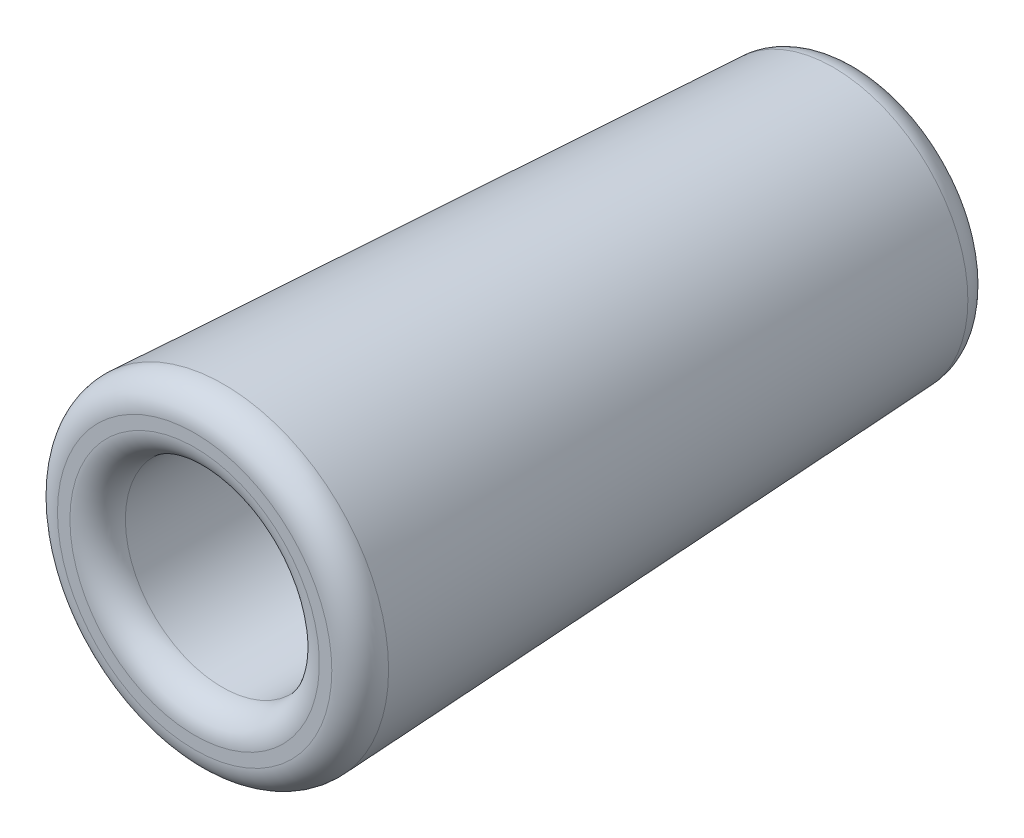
ISO-10303-21;
HEADER;
FILE_DESCRIPTION(('STEP AP214'),'2;1');
FILE_NAME('part.step','',(''),(''),'','','');
FILE_SCHEMA(('AUTOMOTIVE_DESIGN { 1 0 10303 214 1 1 1 1 }'));
ENDSEC;
DATA;
#1=APPLICATION_CONTEXT('core data for automotive mechanical design processes');
#2=APPLICATION_PROTOCOL_DEFINITION('international standard','automotive_design',2000,#1);
#3=PRODUCT_CONTEXT('',#1,'mechanical');
#4=PRODUCT('Part','Part','',(#3));
#5=PRODUCT_RELATED_PRODUCT_CATEGORY('part','',(#4));
#6=PRODUCT_DEFINITION_FORMATION('','',#4);
#7=PRODUCT_DEFINITION_CONTEXT('part definition',#1,'design');
#8=PRODUCT_DEFINITION('design','',#6,#7);
#9=PRODUCT_DEFINITION_SHAPE('','',#8);
#10=(LENGTH_UNIT() NAMED_UNIT(*) SI_UNIT(.MILLI.,.METRE.));
#11=(NAMED_UNIT(*) PLANE_ANGLE_UNIT() SI_UNIT($,.RADIAN.));
#12=(NAMED_UNIT(*) SI_UNIT($,.STERADIAN.) SOLID_ANGLE_UNIT());
#13=UNCERTAINTY_MEASURE_WITH_UNIT(LENGTH_MEASURE(1.E-05),#10,'distance_accuracy_value','');
#14=(GEOMETRIC_REPRESENTATION_CONTEXT(3) GLOBAL_UNCERTAINTY_ASSIGNED_CONTEXT((#13)) GLOBAL_UNIT_ASSIGNED_CONTEXT((#10,
#11,#12)) REPRESENTATION_CONTEXT('',''));
#15=CARTESIAN_POINT('',(0.,0.,0.));
#16=DIRECTION('',(0.,0.,1.));
#17=DIRECTION('',(1.,0.,0.));
#18=AXIS2_PLACEMENT_3D('',#15,#16,#17);
#19=CARTESIAN_POINT('',(0.,1.75,-6.));
#20=DIRECTION('',(0.,0.,-1.));
#21=DIRECTION('',(-1.,0.,0.));
#22=AXIS2_PLACEMENT_3D('',#19,#20,#21);
#23=PLANE('',#22);
#24=CARTESIAN_POINT('',(0.,0.,-6.));
#25=DIRECTION('',(0.,0.,-1.));
#26=DIRECTION('',(-1.,0.,0.));
#27=AXIS2_PLACEMENT_3D('',#24,#25,#26);
#28=CIRCLE('',#27,1.25);
#29=CARTESIAN_POINT('',(-1.25,0.,-6.));
#30=VERTEX_POINT('',#29);
#31=EDGE_CURVE('E44',#30,#30,#28,.F.);
#32=ORIENTED_EDGE('',*,*,#31,.T.);
#33=EDGE_LOOP('',(#32));
#34=FACE_BOUND('',#33,.T.);
#35=ADVANCED_FACE('F29',(#34),#23,.F.);
#36=CARTESIAN_POINT('',(0.,0.,-12.));
#37=DIRECTION('',(0.,0.,1.));
#38=DIRECTION('',(1.,0.,0.));
#39=AXIS2_PLACEMENT_3D('',#36,#37,#38);
#40=PLANE('',#39);
#41=CARTESIAN_POINT('',(0.,0.,-12.));
#42=DIRECTION('',(0.,0.,1.));
#43=DIRECTION('',(1.,0.,0.));
#44=AXIS2_PLACEMENT_3D('',#41,#42,#43);
#45=CIRCLE('',#44,1.92437539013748);
#46=CARTESIAN_POINT('',(1.92437539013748,0.,-12.));
#47=VERTEX_POINT('',#46);
#48=EDGE_CURVE('E10',#47,#47,#45,.F.);
#49=ORIENTED_EDGE('',*,*,#48,.T.);
#50=EDGE_LOOP('',(#49));
#51=FACE_BOUND('',#50,.T.);
#52=ADVANCED_FACE('F73',(#51),#40,.F.);
#53=CARTESIAN_POINT('',(0.,0.,-12.));
#54=DIRECTION('',(0.,0.,1.));
#55=DIRECTION('',(1.,0.,0.));
#56=AXIS2_PLACEMENT_3D('',#53,#54,#55);
#57=CONICAL_SURFACE('',#56,2.4,0.0499583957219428);
#58=CARTESIAN_POINT('',(0.,0.,-11.5249688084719));
#59=DIRECTION('',(0.,0.,-1.));
#60=DIRECTION('',(-1.,0.,0.));
#61=AXIS2_PLACEMENT_3D('',#58,#59,#60);
#62=CIRCLE('',#61,2.4237515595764);
#63=CARTESIAN_POINT('',(-2.4237515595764,0.,-11.5249688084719));
#64=VERTEX_POINT('',#63);
#65=EDGE_CURVE('E36',#64,#64,#62,.F.);
#66=ORIENTED_EDGE('',*,*,#65,.T.);
#67=EDGE_LOOP('',(#66));
#68=FACE_BOUND('',#67,.T.);
#69=CARTESIAN_POINT('',(0.,0.,-0.524968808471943));
#70=DIRECTION('',(0.,0.,-1.));
#71=DIRECTION('',(-1.,0.,0.));
#72=AXIS2_PLACEMENT_3D('',#69,#70,#71);
#73=CIRCLE('',#72,2.9737515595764);
#74=CARTESIAN_POINT('',(-2.9737515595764,0.,-0.524968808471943));
#75=VERTEX_POINT('',#74);
#76=EDGE_CURVE('E40',#75,#75,#73,.T.);
#77=ORIENTED_EDGE('',*,*,#76,.T.);
#78=EDGE_LOOP('',(#77));
#79=FACE_BOUND('',#78,.T.);
#80=ADVANCED_FACE('F78',(#68,#79),#57,.T.);
#81=CARTESIAN_POINT('',(0.,3.,0.));
#82=DIRECTION('',(0.,0.,-1.));
#83=DIRECTION('',(-1.,0.,0.));
#84=AXIS2_PLACEMENT_3D('',#81,#82,#83);
#85=PLANE('',#84);
#86=CARTESIAN_POINT('',(0.,0.,0.));
#87=DIRECTION('',(0.,0.,-1.));
#88=DIRECTION('',(-1.,0.,0.));
#89=AXIS2_PLACEMENT_3D('',#86,#87,#88);
#90=CIRCLE('',#89,2.25);
#91=CARTESIAN_POINT('',(-2.25,0.,0.));
#92=VERTEX_POINT('',#91);
#93=EDGE_CURVE('E49',#92,#92,#90,.T.);
#94=ORIENTED_EDGE('',*,*,#93,.T.);
#95=EDGE_LOOP('',(#94));
#96=FACE_BOUND('',#95,.T.);
#97=CARTESIAN_POINT('',(0.,0.,0.));
#98=DIRECTION('',(0.,0.,-1.));
#99=DIRECTION('',(-1.,0.,0.));
#100=AXIS2_PLACEMENT_3D('',#97,#98,#99);
#101=CIRCLE('',#100,2.47437539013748);
#102=CARTESIAN_POINT('',(-2.47437539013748,0.,0.));
#103=VERTEX_POINT('',#102);
#104=EDGE_CURVE('E52',#103,#103,#101,.F.);
#105=ORIENTED_EDGE('',*,*,#104,.T.);
#106=EDGE_LOOP('',(#105));
#107=FACE_BOUND('',#106,.T.);
#108=ADVANCED_FACE('F97',(#96,#107),#85,.F.);
#109=CARTESIAN_POINT('',(0.,0.,-6.));
#110=DIRECTION('',(0.,0.,1.));
#111=DIRECTION('',(1.,0.,0.));
#112=AXIS2_PLACEMENT_3D('',#109,#110,#111);
#113=CYLINDRICAL_SURFACE('',#112,1.75);
#114=CARTESIAN_POINT('',(0.,0.,-0.5));
#115=DIRECTION('',(0.,0.,-1.));
#116=DIRECTION('',(-1.,0.,0.));
#117=AXIS2_PLACEMENT_3D('',#114,#115,#116);
#118=CIRCLE('',#117,1.75);
#119=CARTESIAN_POINT('',(-1.75,0.,-0.5));
#120=VERTEX_POINT('',#119);
#121=EDGE_CURVE('E55',#120,#120,#118,.F.);
#122=ORIENTED_EDGE('',*,*,#121,.T.);
#123=EDGE_LOOP('',(#122));
#124=FACE_BOUND('',#123,.T.);
#125=CARTESIAN_POINT('',(0.,0.,-5.5));
#126=DIRECTION('',(0.,0.,-1.));
#127=DIRECTION('',(-1.,0.,0.));
#128=AXIS2_PLACEMENT_3D('',#125,#126,#127);
#129=CIRCLE('',#128,1.75);
#130=CARTESIAN_POINT('',(-1.75,0.,-5.5));
#131=VERTEX_POINT('',#130);
#132=EDGE_CURVE('E58',#131,#131,#129,.T.);
#133=ORIENTED_EDGE('',*,*,#132,.T.);
#134=EDGE_LOOP('',(#133));
#135=FACE_BOUND('',#134,.T.);
#136=ADVANCED_FACE('F62',(#124,#135),#113,.F.);
#137=CARTESIAN_POINT('',(0.,0.,-0.5));
#138=DIRECTION('',(0.,0.,-1.));
#139=DIRECTION('',(-1.,0.,0.));
#140=AXIS2_PLACEMENT_3D('',#137,#138,#139);
#141=TOROIDAL_SURFACE('',#140,2.25,0.5);
#142=ORIENTED_EDGE('',*,*,#93,.F.);
#143=EDGE_LOOP('',(#142));
#144=FACE_BOUND('',#143,.T.);
#145=ORIENTED_EDGE('',*,*,#121,.F.);
#146=EDGE_LOOP('',(#145));
#147=FACE_BOUND('',#146,.T.);
#148=ADVANCED_FACE('F68',(#144,#147),#141,.T.);
#149=CARTESIAN_POINT('',(0.,0.,-5.5));
#150=DIRECTION('',(0.,0.,-1.));
#151=DIRECTION('',(-1.,0.,0.));
#152=AXIS2_PLACEMENT_3D('',#149,#150,#151);
#153=TOROIDAL_SURFACE('',#152,1.25,0.5);
#154=ORIENTED_EDGE('',*,*,#132,.F.);
#155=EDGE_LOOP('',(#154));
#156=FACE_BOUND('',#155,.T.);
#157=ORIENTED_EDGE('',*,*,#31,.F.);
#158=EDGE_LOOP('',(#157));
#159=FACE_BOUND('',#158,.T.);
#160=ADVANCED_FACE('F64',(#156,#159),#153,.F.);
#161=CARTESIAN_POINT('',(0.,0.,-11.5));
#162=DIRECTION('',(0.,0.,1.));
#163=DIRECTION('',(1.,0.,0.));
#164=AXIS2_PLACEMENT_3D('',#161,#162,#163);
#165=TOROIDAL_SURFACE('',#164,1.92437539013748,0.5);
#166=ORIENTED_EDGE('',*,*,#48,.F.);
#167=EDGE_LOOP('',(#166));
#168=FACE_BOUND('',#167,.T.);
#169=ORIENTED_EDGE('',*,*,#65,.F.);
#170=EDGE_LOOP('',(#169));
#171=FACE_BOUND('',#170,.T.);
#172=ADVANCED_FACE('F67',(#168,#171),#165,.T.);
#173=CARTESIAN_POINT('',(0.,0.,-0.5));
#174=DIRECTION('',(0.,0.,-1.));
#175=DIRECTION('',(-1.,0.,0.));
#176=AXIS2_PLACEMENT_3D('',#173,#174,#175);
#177=TOROIDAL_SURFACE('',#176,2.47437539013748,0.5);
#178=ORIENTED_EDGE('',*,*,#76,.F.);
#179=EDGE_LOOP('',(#178));
#180=FACE_BOUND('',#179,.T.);
#181=ORIENTED_EDGE('',*,*,#104,.F.);
#182=EDGE_LOOP('',(#181));
#183=FACE_BOUND('',#182,.T.);
#184=ADVANCED_FACE('F31',(#180,#183),#177,.T.);
#185=CLOSED_SHELL('',(#35,#52,#80,#108,#136,#148,#160,#172,#184));
#186=MANIFOLD_SOLID_BREP('B2',#185);
#187=ADVANCED_BREP_SHAPE_REPRESENTATION('',(#18,#186),#14);
#188=SHAPE_DEFINITION_REPRESENTATION(#9,#187);
ENDSEC;
END-ISO-10303-21;
